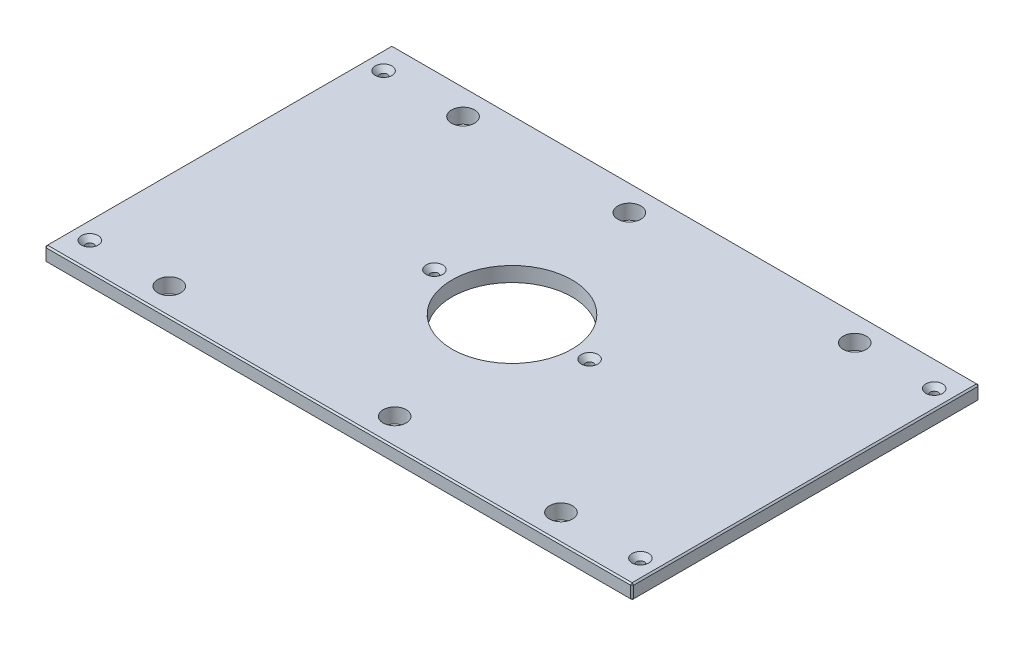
ISO-10303-21;
HEADER;
FILE_DESCRIPTION(('STEP AP214'),'2;1');
FILE_NAME('part.step','',(''),(''),'','','');
FILE_SCHEMA(('AUTOMOTIVE_DESIGN { 1 0 10303 214 1 1 1 1 }'));
ENDSEC;
DATA;
#1=APPLICATION_CONTEXT('core data for automotive mechanical design processes');
#2=APPLICATION_PROTOCOL_DEFINITION('international standard','automotive_design',2000,#1);
#3=PRODUCT_CONTEXT('',#1,'mechanical');
#4=PRODUCT('Part','Part','',(#3));
#5=PRODUCT_RELATED_PRODUCT_CATEGORY('part','',(#4));
#6=PRODUCT_DEFINITION_FORMATION('','',#4);
#7=PRODUCT_DEFINITION_CONTEXT('part definition',#1,'design');
#8=PRODUCT_DEFINITION('design','',#6,#7);
#9=PRODUCT_DEFINITION_SHAPE('','',#8);
#10=(LENGTH_UNIT() NAMED_UNIT(*) SI_UNIT(.MILLI.,.METRE.));
#11=(NAMED_UNIT(*) PLANE_ANGLE_UNIT() SI_UNIT($,.RADIAN.));
#12=(NAMED_UNIT(*) SI_UNIT($,.STERADIAN.) SOLID_ANGLE_UNIT());
#13=UNCERTAINTY_MEASURE_WITH_UNIT(LENGTH_MEASURE(1.E-05),#10,'distance_accuracy_value','');
#14=(GEOMETRIC_REPRESENTATION_CONTEXT(3) GLOBAL_UNCERTAINTY_ASSIGNED_CONTEXT((#13)) GLOBAL_UNIT_ASSIGNED_CONTEXT((#10,
#11,#12)) REPRESENTATION_CONTEXT('',''));
#15=CARTESIAN_POINT('',(0.,0.,0.));
#16=DIRECTION('',(0.,0.,1.));
#17=DIRECTION('',(1.,0.,0.));
#18=AXIS2_PLACEMENT_3D('',#15,#16,#17);
#19=CARTESIAN_POINT('',(-252.4125,12.7,-149.225));
#20=DIRECTION('',(1.,0.,0.));
#21=DIRECTION('',(0.,0.,-1.));
#22=AXIS2_PLACEMENT_3D('',#19,#20,#21);
#23=PLANE('',#22);
#24=DIRECTION('',(0.,0.,-1.));
#25=VECTOR('',#24,1.);
#26=CARTESIAN_POINT('',(-252.4125,11.4299999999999,-149.225));
#27=LINE('',#26,#25);
#28=CARTESIAN_POINT('',(-252.4125,11.4299999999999,147.955));
#29=VERTEX_POINT('',#28);
#30=CARTESIAN_POINT('',(-252.4125,11.4299999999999,-147.955));
#31=VERTEX_POINT('',#30);
#32=EDGE_CURVE('E135',#29,#31,#27,.T.);
#33=ORIENTED_EDGE('',*,*,#32,.T.);
#34=DIRECTION('',(0.,-1.,0.));
#35=VECTOR('',#34,1.);
#36=CARTESIAN_POINT('',(-252.4125,12.7,-147.955));
#37=LINE('',#36,#35);
#38=CARTESIAN_POINT('',(-252.4125,1.27000000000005,-147.955));
#39=VERTEX_POINT('',#38);
#40=EDGE_CURVE('E131',#31,#39,#37,.T.);
#41=ORIENTED_EDGE('',*,*,#40,.T.);
#42=DIRECTION('',(0.,0.,1.));
#43=VECTOR('',#42,1.);
#44=CARTESIAN_POINT('',(-252.4125,1.27000000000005,-149.225));
#45=LINE('',#44,#43);
#46=CARTESIAN_POINT('',(-252.4125,1.27000000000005,147.955));
#47=VERTEX_POINT('',#46);
#48=EDGE_CURVE('E126',#39,#47,#45,.T.);
#49=ORIENTED_EDGE('',*,*,#48,.T.);
#50=DIRECTION('',(0.,1.,0.));
#51=VECTOR('',#50,1.);
#52=CARTESIAN_POINT('',(-252.4125,12.7,147.955));
#53=LINE('',#52,#51);
#54=EDGE_CURVE('E128',#47,#29,#53,.T.);
#55=ORIENTED_EDGE('',*,*,#54,.T.);
#56=EDGE_LOOP('',(#33,#41,#49,#55));
#57=FACE_BOUND('',#56,.T.);
#58=ADVANCED_FACE('F35',(#57),#23,.F.);
#59=CARTESIAN_POINT('',(-252.4125,12.7,149.225));
#60=DIRECTION('',(0.,0.,-1.));
#61=DIRECTION('',(-1.,0.,0.));
#62=AXIS2_PLACEMENT_3D('',#59,#60,#61);
#63=PLANE('',#62);
#64=DIRECTION('',(1.,0.,0.));
#65=VECTOR('',#64,1.);
#66=CARTESIAN_POINT('',(-252.4125,1.26999999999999,149.225));
#67=LINE('',#66,#65);
#68=CARTESIAN_POINT('',(-251.1425,1.26999999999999,149.225));
#69=VERTEX_POINT('',#68);
#70=CARTESIAN_POINT('',(251.1425,1.26999999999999,149.225));
#71=VERTEX_POINT('',#70);
#72=EDGE_CURVE('E58',#69,#71,#67,.T.);
#73=ORIENTED_EDGE('',*,*,#72,.T.);
#74=DIRECTION('',(0.,1.,0.));
#75=VECTOR('',#74,1.);
#76=CARTESIAN_POINT('',(251.1425,12.7,149.225));
#77=LINE('',#76,#75);
#78=CARTESIAN_POINT('',(251.1425,11.43,149.225));
#79=VERTEX_POINT('',#78);
#80=EDGE_CURVE('E11',#71,#79,#77,.T.);
#81=ORIENTED_EDGE('',*,*,#80,.T.);
#82=DIRECTION('',(-1.,0.,0.));
#83=VECTOR('',#82,1.);
#84=CARTESIAN_POINT('',(-252.4125,11.43,149.225));
#85=LINE('',#84,#83);
#86=CARTESIAN_POINT('',(-251.1425,11.43,149.225));
#87=VERTEX_POINT('',#86);
#88=EDGE_CURVE('E44',#79,#87,#85,.T.);
#89=ORIENTED_EDGE('',*,*,#88,.T.);
#90=DIRECTION('',(0.,-1.,0.));
#91=VECTOR('',#90,1.);
#92=CARTESIAN_POINT('',(-251.1425,12.7,149.225));
#93=LINE('',#92,#91);
#94=EDGE_CURVE('E291',#87,#69,#93,.T.);
#95=ORIENTED_EDGE('',*,*,#94,.T.);
#96=EDGE_LOOP('',(#73,#81,#89,#95));
#97=FACE_BOUND('',#96,.T.);
#98=ADVANCED_FACE('F360',(#97),#63,.F.);
#99=CARTESIAN_POINT('',(252.4125,12.7,-149.225));
#100=DIRECTION('',(-1.,0.,0.));
#101=DIRECTION('',(0.,0.,1.));
#102=AXIS2_PLACEMENT_3D('',#99,#100,#101);
#103=PLANE('',#102);
#104=DIRECTION('',(0.,0.,-1.));
#105=VECTOR('',#104,1.);
#106=CARTESIAN_POINT('',(252.4125,1.26999999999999,-149.225));
#107=LINE('',#106,#105);
#108=CARTESIAN_POINT('',(252.4125,1.26999999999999,147.955));
#109=VERTEX_POINT('',#108);
#110=CARTESIAN_POINT('',(252.4125,1.26999999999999,-147.955));
#111=VERTEX_POINT('',#110);
#112=EDGE_CURVE('E286',#109,#111,#107,.T.);
#113=ORIENTED_EDGE('',*,*,#112,.T.);
#114=DIRECTION('',(0.,1.,0.));
#115=VECTOR('',#114,1.);
#116=CARTESIAN_POINT('',(252.4125,12.7,-147.955));
#117=LINE('',#116,#115);
#118=CARTESIAN_POINT('',(252.4125,11.4299999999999,-147.955));
#119=VERTEX_POINT('',#118);
#120=EDGE_CURVE('E288',#111,#119,#117,.T.);
#121=ORIENTED_EDGE('',*,*,#120,.T.);
#122=DIRECTION('',(0.,0.,1.));
#123=VECTOR('',#122,1.);
#124=CARTESIAN_POINT('',(252.4125,11.4299999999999,149.225));
#125=LINE('',#124,#123);
#126=CARTESIAN_POINT('',(252.4125,11.4299999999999,147.955));
#127=VERTEX_POINT('',#126);
#128=EDGE_CURVE('E284',#119,#127,#125,.T.);
#129=ORIENTED_EDGE('',*,*,#128,.T.);
#130=DIRECTION('',(0.,-1.,0.));
#131=VECTOR('',#130,1.);
#132=CARTESIAN_POINT('',(252.4125,12.7,147.955));
#133=LINE('',#132,#131);
#134=EDGE_CURVE('E282',#127,#109,#133,.T.);
#135=ORIENTED_EDGE('',*,*,#134,.T.);
#136=EDGE_LOOP('',(#113,#121,#129,#135));
#137=FACE_BOUND('',#136,.T.);
#138=ADVANCED_FACE('F347',(#137),#103,.F.);
#139=CARTESIAN_POINT('',(-252.4125,12.7,-149.225));
#140=DIRECTION('',(0.,0.,1.));
#141=DIRECTION('',(1.,0.,0.));
#142=AXIS2_PLACEMENT_3D('',#139,#140,#141);
#143=PLANE('',#142);
#144=DIRECTION('',(-1.,0.,0.));
#145=VECTOR('',#144,1.);
#146=CARTESIAN_POINT('',(-252.4125,1.26999999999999,-149.225));
#147=LINE('',#146,#145);
#148=CARTESIAN_POINT('',(251.1425,1.26999999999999,-149.225));
#149=VERTEX_POINT('',#148);
#150=CARTESIAN_POINT('',(-251.1425,1.26999999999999,-149.225));
#151=VERTEX_POINT('',#150);
#152=EDGE_CURVE('E258',#149,#151,#147,.T.);
#153=ORIENTED_EDGE('',*,*,#152,.T.);
#154=DIRECTION('',(0.,1.,0.));
#155=VECTOR('',#154,1.);
#156=CARTESIAN_POINT('',(-251.1425,12.7,-149.225));
#157=LINE('',#156,#155);
#158=CARTESIAN_POINT('',(-251.1425,11.4299999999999,-149.225));
#159=VERTEX_POINT('',#158);
#160=EDGE_CURVE('E262',#151,#159,#157,.T.);
#161=ORIENTED_EDGE('',*,*,#160,.T.);
#162=DIRECTION('',(1.,0.,0.));
#163=VECTOR('',#162,1.);
#164=CARTESIAN_POINT('',(252.4125,11.4299999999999,-149.225));
#165=LINE('',#164,#163);
#166=CARTESIAN_POINT('',(251.1425,11.4299999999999,-149.225));
#167=VERTEX_POINT('',#166);
#168=EDGE_CURVE('E260',#159,#167,#165,.T.);
#169=ORIENTED_EDGE('',*,*,#168,.T.);
#170=DIRECTION('',(0.,-1.,0.));
#171=VECTOR('',#170,1.);
#172=CARTESIAN_POINT('',(251.1425,12.7,-149.225));
#173=LINE('',#172,#171);
#174=EDGE_CURVE('E256',#167,#149,#173,.T.);
#175=ORIENTED_EDGE('',*,*,#174,.T.);
#176=EDGE_LOOP('',(#153,#161,#169,#175));
#177=FACE_BOUND('',#176,.T.);
#178=ADVANCED_FACE('F321',(#177),#143,.F.);
#179=CARTESIAN_POINT('',(0.,12.7,0.));
#180=DIRECTION('',(0.,1.,0.));
#181=DIRECTION('',(0.,0.,1.));
#182=AXIS2_PLACEMENT_3D('',#179,#180,#181);
#183=PLANE('',#182);
#184=CARTESIAN_POINT('',(236.5375,12.7,-126.20498));
#185=DIRECTION('',(0.,1.,0.));
#186=DIRECTION('',(0.,0.,1.));
#187=AXIS2_PLACEMENT_3D('',#184,#185,#186);
#188=CIRCLE('',#187,7.13739999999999);
#189=CARTESIAN_POINT('',(236.5375,12.7,-119.06758));
#190=VERTEX_POINT('',#189);
#191=EDGE_CURVE('E784',#190,#190,#188,.T.);
#192=ORIENTED_EDGE('',*,*,#191,.F.);
#193=EDGE_LOOP('',(#192));
#194=FACE_BOUND('',#193,.T.);
#195=CARTESIAN_POINT('',(236.5375,12.7,126.20498));
#196=DIRECTION('',(0.,1.,0.));
#197=DIRECTION('',(0.,0.,1.));
#198=AXIS2_PLACEMENT_3D('',#195,#196,#197);
#199=CIRCLE('',#198,7.13739999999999);
#200=CARTESIAN_POINT('',(236.5375,12.7,133.34238));
#201=VERTEX_POINT('',#200);
#202=EDGE_CURVE('E788',#201,#201,#199,.T.);
#203=ORIENTED_EDGE('',*,*,#202,.F.);
#204=EDGE_LOOP('',(#203));
#205=FACE_BOUND('',#204,.T.);
#206=CARTESIAN_POINT('',(-236.5375,12.7,126.20498));
#207=DIRECTION('',(0.,1.,0.));
#208=DIRECTION('',(0.,0.,1.));
#209=AXIS2_PLACEMENT_3D('',#206,#207,#208);
#210=CIRCLE('',#209,7.13739999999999);
#211=CARTESIAN_POINT('',(-236.5375,12.7,133.34238));
#212=VERTEX_POINT('',#211);
#213=EDGE_CURVE('E792',#212,#212,#210,.T.);
#214=ORIENTED_EDGE('',*,*,#213,.F.);
#215=EDGE_LOOP('',(#214));
#216=FACE_BOUND('',#215,.T.);
#217=CARTESIAN_POINT('',(-66.675,12.7,0.));
#218=DIRECTION('',(0.,1.,0.));
#219=DIRECTION('',(0.,0.,1.));
#220=AXIS2_PLACEMENT_3D('',#217,#218,#219);
#221=CIRCLE('',#220,7.1374);
#222=CARTESIAN_POINT('',(-66.675,12.7,7.1374));
#223=VERTEX_POINT('',#222);
#224=EDGE_CURVE('E796',#223,#223,#221,.T.);
#225=ORIENTED_EDGE('',*,*,#224,.F.);
#226=EDGE_LOOP('',(#225));
#227=FACE_BOUND('',#226,.T.);
#228=CARTESIAN_POINT('',(66.675,12.7,0.));
#229=DIRECTION('',(0.,1.,0.));
#230=DIRECTION('',(0.,0.,1.));
#231=AXIS2_PLACEMENT_3D('',#228,#229,#230);
#232=CIRCLE('',#231,7.1374);
#233=CARTESIAN_POINT('',(66.675,12.7,7.1374));
#234=VERTEX_POINT('',#233);
#235=EDGE_CURVE('E800',#234,#234,#232,.T.);
#236=ORIENTED_EDGE('',*,*,#235,.F.);
#237=EDGE_LOOP('',(#236));
#238=FACE_BOUND('',#237,.T.);
#239=CARTESIAN_POINT('',(-236.5375,12.7,-126.20498));
#240=DIRECTION('',(0.,1.,0.));
#241=DIRECTION('',(0.,0.,1.));
#242=AXIS2_PLACEMENT_3D('',#239,#240,#241);
#243=CIRCLE('',#242,7.13739999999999);
#244=CARTESIAN_POINT('',(-236.5375,12.7,-119.06758));
#245=VERTEX_POINT('',#244);
#246=EDGE_CURVE('E803',#245,#245,#243,.T.);
#247=ORIENTED_EDGE('',*,*,#246,.F.);
#248=EDGE_LOOP('',(#247));
#249=FACE_BOUND('',#248,.T.);
#250=DIRECTION('',(0.,0.,-1.));
#251=VECTOR('',#250,1.);
#252=CARTESIAN_POINT('',(251.1425,12.7,-149.225));
#253=LINE('',#252,#251);
#254=CARTESIAN_POINT('',(251.1425,12.7,147.955));
#255=VERTEX_POINT('',#254);
#256=CARTESIAN_POINT('',(251.1425,12.7,-147.955));
#257=VERTEX_POINT('',#256);
#258=EDGE_CURVE('E269',#255,#257,#253,.T.);
#259=ORIENTED_EDGE('',*,*,#258,.T.);
#260=DIRECTION('',(-1.,0.,0.));
#261=VECTOR('',#260,1.);
#262=CARTESIAN_POINT('',(-252.4125,12.7,-147.955));
#263=LINE('',#262,#261);
#264=CARTESIAN_POINT('',(-251.1425,12.7,-147.955));
#265=VERTEX_POINT('',#264);
#266=EDGE_CURVE('E271',#257,#265,#263,.T.);
#267=ORIENTED_EDGE('',*,*,#266,.T.);
#268=DIRECTION('',(0.,0.,1.));
#269=VECTOR('',#268,1.);
#270=CARTESIAN_POINT('',(-251.1425,12.7,149.225));
#271=LINE('',#270,#269);
#272=CARTESIAN_POINT('',(-251.1425,12.7,147.955));
#273=VERTEX_POINT('',#272);
#274=EDGE_CURVE('E267',#265,#273,#271,.T.);
#275=ORIENTED_EDGE('',*,*,#274,.T.);
#276=DIRECTION('',(1.,0.,0.));
#277=VECTOR('',#276,1.);
#278=CARTESIAN_POINT('',(252.4125,12.7,147.955));
#279=LINE('',#278,#277);
#280=EDGE_CURVE('E265',#273,#255,#279,.T.);
#281=ORIENTED_EDGE('',*,*,#280,.T.);
#282=EDGE_LOOP('',(#259,#267,#275,#281));
#283=FACE_BOUND('',#282,.T.);
#284=CARTESIAN_POINT('',(168.275,12.7,-126.20498));
#285=DIRECTION('',(0.,1.,0.));
#286=DIRECTION('',(0.,0.,1.));
#287=AXIS2_PLACEMENT_3D('',#284,#285,#286);
#288=CIRCLE('',#287,9.921875);
#289=CARTESIAN_POINT('',(168.275,12.7,-116.283105));
#290=VERTEX_POINT('',#289);
#291=EDGE_CURVE('E204',#290,#290,#288,.T.);
#292=ORIENTED_EDGE('',*,*,#291,.F.);
#293=EDGE_LOOP('',(#292));
#294=FACE_BOUND('',#293,.T.);
#295=CARTESIAN_POINT('',(-168.275,12.7,-126.20498));
#296=DIRECTION('',(0.,1.,0.));
#297=DIRECTION('',(0.,0.,1.));
#298=AXIS2_PLACEMENT_3D('',#295,#296,#297);
#299=CIRCLE('',#298,9.921875);
#300=CARTESIAN_POINT('',(-168.275,12.7,-116.283105));
#301=VERTEX_POINT('',#300);
#302=EDGE_CURVE('E214',#301,#301,#299,.T.);
#303=ORIENTED_EDGE('',*,*,#302,.F.);
#304=EDGE_LOOP('',(#303));
#305=FACE_BOUND('',#304,.T.);
#306=CARTESIAN_POINT('',(168.275,12.7,126.20498));
#307=DIRECTION('',(0.,1.,0.));
#308=DIRECTION('',(0.,0.,1.));
#309=AXIS2_PLACEMENT_3D('',#306,#307,#308);
#310=CIRCLE('',#309,9.921875);
#311=CARTESIAN_POINT('',(168.275,12.7,136.126855));
#312=VERTEX_POINT('',#311);
#313=EDGE_CURVE('E225',#312,#312,#310,.T.);
#314=ORIENTED_EDGE('',*,*,#313,.F.);
#315=EDGE_LOOP('',(#314));
#316=FACE_BOUND('',#315,.T.);
#317=CARTESIAN_POINT('',(-168.275,12.7,126.20498));
#318=DIRECTION('',(0.,1.,0.));
#319=DIRECTION('',(0.,0.,1.));
#320=AXIS2_PLACEMENT_3D('',#317,#318,#319);
#321=CIRCLE('',#320,9.921875);
#322=CARTESIAN_POINT('',(-168.275,12.7,136.126855));
#323=VERTEX_POINT('',#322);
#324=EDGE_CURVE('E231',#323,#323,#321,.T.);
#325=ORIENTED_EDGE('',*,*,#324,.F.);
#326=EDGE_LOOP('',(#325));
#327=FACE_BOUND('',#326,.T.);
#328=CARTESIAN_POINT('',(-25.4,12.7,-126.20498));
#329=DIRECTION('',(0.,1.,0.));
#330=DIRECTION('',(0.,0.,1.));
#331=AXIS2_PLACEMENT_3D('',#328,#329,#330);
#332=CIRCLE('',#331,9.921875);
#333=CARTESIAN_POINT('',(-25.4,12.7,-116.283105));
#334=VERTEX_POINT('',#333);
#335=EDGE_CURVE('E237',#334,#334,#332,.T.);
#336=ORIENTED_EDGE('',*,*,#335,.F.);
#337=EDGE_LOOP('',(#336));
#338=FACE_BOUND('',#337,.T.);
#339=CARTESIAN_POINT('',(25.4,12.7,126.20498));
#340=DIRECTION('',(0.,1.,0.));
#341=DIRECTION('',(0.,0.,1.));
#342=AXIS2_PLACEMENT_3D('',#339,#340,#341);
#343=CIRCLE('',#342,9.921875);
#344=CARTESIAN_POINT('',(25.4,12.7,136.126855));
#345=VERTEX_POINT('',#344);
#346=EDGE_CURVE('E243',#345,#345,#343,.T.);
#347=ORIENTED_EDGE('',*,*,#346,.F.);
#348=EDGE_LOOP('',(#347));
#349=FACE_BOUND('',#348,.T.);
#350=CARTESIAN_POINT('',(0.,12.7,0.));
#351=DIRECTION('',(0.,1.,0.));
#352=DIRECTION('',(0.,0.,1.));
#353=AXIS2_PLACEMENT_3D('',#350,#351,#352);
#354=CIRCLE('',#353,51.562);
#355=CARTESIAN_POINT('',(0.,12.7,51.562));
#356=VERTEX_POINT('',#355);
#357=EDGE_CURVE('E249',#356,#356,#354,.T.);
#358=ORIENTED_EDGE('',*,*,#357,.F.);
#359=EDGE_LOOP('',(#358));
#360=FACE_BOUND('',#359,.T.);
#361=ADVANCED_FACE('F369',(#194,#205,#216,#227,#238,#249,#283,#294,#305,#316,#327,#338,#349,
#360),#183,.T.);
#362=CARTESIAN_POINT('',(0.,0.,0.));
#363=DIRECTION('',(0.,1.,0.));
#364=DIRECTION('',(0.,0.,1.));
#365=AXIS2_PLACEMENT_3D('',#362,#363,#364);
#366=PLANE('',#365);
#367=CARTESIAN_POINT('',(236.5375,0.,-126.20498));
#368=DIRECTION('',(0.,1.,0.));
#369=DIRECTION('',(0.,0.,1.));
#370=AXIS2_PLACEMENT_3D('',#367,#368,#369);
#371=CIRCLE('',#370,3.3782);
#372=CARTESIAN_POINT('',(236.5375,0.,-122.82678));
#373=VERTEX_POINT('',#372);
#374=EDGE_CURVE('E837',#373,#373,#371,.T.);
#375=ORIENTED_EDGE('',*,*,#374,.T.);
#376=EDGE_LOOP('',(#375));
#377=FACE_BOUND('',#376,.T.);
#378=CARTESIAN_POINT('',(236.5375,0.,126.20498));
#379=DIRECTION('',(0.,1.,0.));
#380=DIRECTION('',(0.,0.,1.));
#381=AXIS2_PLACEMENT_3D('',#378,#379,#380);
#382=CIRCLE('',#381,3.3782);
#383=CARTESIAN_POINT('',(236.5375,0.,129.58318));
#384=VERTEX_POINT('',#383);
#385=EDGE_CURVE('E830',#384,#384,#382,.T.);
#386=ORIENTED_EDGE('',*,*,#385,.T.);
#387=EDGE_LOOP('',(#386));
#388=FACE_BOUND('',#387,.T.);
#389=CARTESIAN_POINT('',(-236.5375,0.,126.20498));
#390=DIRECTION('',(0.,1.,0.));
#391=DIRECTION('',(0.,0.,1.));
#392=AXIS2_PLACEMENT_3D('',#389,#390,#391);
#393=CIRCLE('',#392,3.3782);
#394=CARTESIAN_POINT('',(-236.5375,0.,129.58318));
#395=VERTEX_POINT('',#394);
#396=EDGE_CURVE('E823',#395,#395,#393,.T.);
#397=ORIENTED_EDGE('',*,*,#396,.T.);
#398=EDGE_LOOP('',(#397));
#399=FACE_BOUND('',#398,.T.);
#400=CARTESIAN_POINT('',(-66.675,0.,0.));
#401=DIRECTION('',(0.,1.,0.));
#402=DIRECTION('',(0.,0.,1.));
#403=AXIS2_PLACEMENT_3D('',#400,#401,#402);
#404=CIRCLE('',#403,3.3782);
#405=CARTESIAN_POINT('',(-66.675,0.,3.3782));
#406=VERTEX_POINT('',#405);
#407=EDGE_CURVE('E816',#406,#406,#404,.T.);
#408=ORIENTED_EDGE('',*,*,#407,.T.);
#409=EDGE_LOOP('',(#408));
#410=FACE_BOUND('',#409,.T.);
#411=CARTESIAN_POINT('',(66.675,0.,0.));
#412=DIRECTION('',(0.,1.,0.));
#413=DIRECTION('',(0.,0.,1.));
#414=AXIS2_PLACEMENT_3D('',#411,#412,#413);
#415=CIRCLE('',#414,3.3782);
#416=CARTESIAN_POINT('',(66.675,0.,3.3782));
#417=VERTEX_POINT('',#416);
#418=EDGE_CURVE('E806',#417,#417,#415,.T.);
#419=ORIENTED_EDGE('',*,*,#418,.T.);
#420=EDGE_LOOP('',(#419));
#421=FACE_BOUND('',#420,.T.);
#422=CARTESIAN_POINT('',(-236.5375,0.,-126.20498));
#423=DIRECTION('',(0.,1.,0.));
#424=DIRECTION('',(0.,0.,1.));
#425=AXIS2_PLACEMENT_3D('',#422,#423,#424);
#426=CIRCLE('',#425,3.3782);
#427=CARTESIAN_POINT('',(-236.5375,0.,-122.82678));
#428=VERTEX_POINT('',#427);
#429=EDGE_CURVE('E217',#428,#428,#426,.T.);
#430=ORIENTED_EDGE('',*,*,#429,.T.);
#431=EDGE_LOOP('',(#430));
#432=FACE_BOUND('',#431,.T.);
#433=DIRECTION('',(0.,0.,-1.));
#434=VECTOR('',#433,1.);
#435=CARTESIAN_POINT('',(-251.1425,0.,0.));
#436=LINE('',#435,#434);
#437=CARTESIAN_POINT('',(-251.1425,0.,147.955));
#438=VERTEX_POINT('',#437);
#439=CARTESIAN_POINT('',(-251.1425,0.,-147.955));
#440=VERTEX_POINT('',#439);
#441=EDGE_CURVE('E158',#438,#440,#436,.T.);
#442=ORIENTED_EDGE('',*,*,#441,.T.);
#443=DIRECTION('',(1.,0.,0.));
#444=VECTOR('',#443,1.);
#445=CARTESIAN_POINT('',(0.,0.,-147.955));
#446=LINE('',#445,#444);
#447=CARTESIAN_POINT('',(251.1425,0.,-147.955));
#448=VERTEX_POINT('',#447);
#449=EDGE_CURVE('E279',#440,#448,#446,.T.);
#450=ORIENTED_EDGE('',*,*,#449,.T.);
#451=DIRECTION('',(0.,0.,1.));
#452=VECTOR('',#451,1.);
#453=CARTESIAN_POINT('',(251.1425,0.,0.));
#454=LINE('',#453,#452);
#455=CARTESIAN_POINT('',(251.1425,0.,147.955));
#456=VERTEX_POINT('',#455);
#457=EDGE_CURVE('E277',#448,#456,#454,.T.);
#458=ORIENTED_EDGE('',*,*,#457,.T.);
#459=DIRECTION('',(-1.,0.,0.));
#460=VECTOR('',#459,1.);
#461=CARTESIAN_POINT('',(0.,0.,147.955));
#462=LINE('',#461,#460);
#463=EDGE_CURVE('E274',#456,#438,#462,.T.);
#464=ORIENTED_EDGE('',*,*,#463,.T.);
#465=EDGE_LOOP('',(#442,#450,#458,#464));
#466=FACE_BOUND('',#465,.T.);
#467=CARTESIAN_POINT('',(168.275,0.,-126.20498));
#468=DIRECTION('',(0.,1.,0.));
#469=DIRECTION('',(0.,0.,1.));
#470=AXIS2_PLACEMENT_3D('',#467,#468,#469);
#471=CIRCLE('',#470,9.921875);
#472=CARTESIAN_POINT('',(168.275,0.,-116.283105));
#473=VERTEX_POINT('',#472);
#474=EDGE_CURVE('E209',#473,#473,#471,.T.);
#475=ORIENTED_EDGE('',*,*,#474,.T.);
#476=EDGE_LOOP('',(#475));
#477=FACE_BOUND('',#476,.T.);
#478=CARTESIAN_POINT('',(-168.275,0.,-126.20498));
#479=DIRECTION('',(0.,1.,0.));
#480=DIRECTION('',(0.,0.,1.));
#481=AXIS2_PLACEMENT_3D('',#478,#479,#480);
#482=CIRCLE('',#481,9.921875);
#483=CARTESIAN_POINT('',(-168.275,0.,-116.283105));
#484=VERTEX_POINT('',#483);
#485=EDGE_CURVE('E222',#484,#484,#482,.T.);
#486=ORIENTED_EDGE('',*,*,#485,.T.);
#487=EDGE_LOOP('',(#486));
#488=FACE_BOUND('',#487,.T.);
#489=CARTESIAN_POINT('',(168.275,0.,126.20498));
#490=DIRECTION('',(0.,1.,0.));
#491=DIRECTION('',(0.,0.,1.));
#492=AXIS2_PLACEMENT_3D('',#489,#490,#491);
#493=CIRCLE('',#492,9.921875);
#494=CARTESIAN_POINT('',(168.275,0.,136.126855));
#495=VERTEX_POINT('',#494);
#496=EDGE_CURVE('E228',#495,#495,#493,.T.);
#497=ORIENTED_EDGE('',*,*,#496,.T.);
#498=EDGE_LOOP('',(#497));
#499=FACE_BOUND('',#498,.T.);
#500=CARTESIAN_POINT('',(-168.275,0.,126.20498));
#501=DIRECTION('',(0.,1.,0.));
#502=DIRECTION('',(0.,0.,1.));
#503=AXIS2_PLACEMENT_3D('',#500,#501,#502);
#504=CIRCLE('',#503,9.921875);
#505=CARTESIAN_POINT('',(-168.275,0.,136.126855));
#506=VERTEX_POINT('',#505);
#507=EDGE_CURVE('E234',#506,#506,#504,.T.);
#508=ORIENTED_EDGE('',*,*,#507,.T.);
#509=EDGE_LOOP('',(#508));
#510=FACE_BOUND('',#509,.T.);
#511=CARTESIAN_POINT('',(-25.4,0.,-126.20498));
#512=DIRECTION('',(0.,1.,0.));
#513=DIRECTION('',(0.,0.,1.));
#514=AXIS2_PLACEMENT_3D('',#511,#512,#513);
#515=CIRCLE('',#514,9.921875);
#516=CARTESIAN_POINT('',(-25.4,0.,-116.283105));
#517=VERTEX_POINT('',#516);
#518=EDGE_CURVE('E240',#517,#517,#515,.T.);
#519=ORIENTED_EDGE('',*,*,#518,.T.);
#520=EDGE_LOOP('',(#519));
#521=FACE_BOUND('',#520,.T.);
#522=CARTESIAN_POINT('',(25.4,0.,126.20498));
#523=DIRECTION('',(0.,1.,0.));
#524=DIRECTION('',(0.,0.,1.));
#525=AXIS2_PLACEMENT_3D('',#522,#523,#524);
#526=CIRCLE('',#525,9.921875);
#527=CARTESIAN_POINT('',(25.4,0.,136.126855));
#528=VERTEX_POINT('',#527);
#529=EDGE_CURVE('E246',#528,#528,#526,.T.);
#530=ORIENTED_EDGE('',*,*,#529,.T.);
#531=EDGE_LOOP('',(#530));
#532=FACE_BOUND('',#531,.T.);
#533=CARTESIAN_POINT('',(0.,0.,0.));
#534=DIRECTION('',(0.,1.,0.));
#535=DIRECTION('',(0.,0.,1.));
#536=AXIS2_PLACEMENT_3D('',#533,#534,#535);
#537=CIRCLE('',#536,51.562);
#538=CARTESIAN_POINT('',(0.,0.,51.562));
#539=VERTEX_POINT('',#538);
#540=EDGE_CURVE('E147',#539,#539,#537,.T.);
#541=ORIENTED_EDGE('',*,*,#540,.T.);
#542=EDGE_LOOP('',(#541));
#543=FACE_BOUND('',#542,.T.);
#544=ADVANCED_FACE('F334',(#377,#388,#399,#410,#421,#432,#466,#477,#488,#499,#510,#521,#532,
#543),#366,.F.);
#545=CARTESIAN_POINT('',(0.,0.,0.));
#546=DIRECTION('',(0.,1.,0.));
#547=DIRECTION('',(0.,0.,1.));
#548=AXIS2_PLACEMENT_3D('',#545,#546,#547);
#549=CYLINDRICAL_SURFACE('',#548,51.562);
#550=ORIENTED_EDGE('',*,*,#540,.F.);
#551=EDGE_LOOP('',(#550));
#552=FACE_BOUND('',#551,.T.);
#553=ORIENTED_EDGE('',*,*,#357,.T.);
#554=EDGE_LOOP('',(#553));
#555=FACE_BOUND('',#554,.T.);
#556=ADVANCED_FACE('F721',(#552,#555),#549,.F.);
#557=CARTESIAN_POINT('',(25.4,12.7,126.20498));
#558=DIRECTION('',(0.,1.,0.));
#559=DIRECTION('',(0.,0.,1.));
#560=AXIS2_PLACEMENT_3D('',#557,#558,#559);
#561=CYLINDRICAL_SURFACE('',#560,9.921875);
#562=ORIENTED_EDGE('',*,*,#529,.F.);
#563=EDGE_LOOP('',(#562));
#564=FACE_BOUND('',#563,.T.);
#565=ORIENTED_EDGE('',*,*,#346,.T.);
#566=EDGE_LOOP('',(#565));
#567=FACE_BOUND('',#566,.T.);
#568=ADVANCED_FACE('F712',(#564,#567),#561,.F.);
#569=CARTESIAN_POINT('',(-25.4,12.7,-126.20498));
#570=DIRECTION('',(0.,1.,0.));
#571=DIRECTION('',(0.,0.,1.));
#572=AXIS2_PLACEMENT_3D('',#569,#570,#571);
#573=CYLINDRICAL_SURFACE('',#572,9.921875);
#574=ORIENTED_EDGE('',*,*,#518,.F.);
#575=EDGE_LOOP('',(#574));
#576=FACE_BOUND('',#575,.T.);
#577=ORIENTED_EDGE('',*,*,#335,.T.);
#578=EDGE_LOOP('',(#577));
#579=FACE_BOUND('',#578,.T.);
#580=ADVANCED_FACE('F703',(#576,#579),#573,.F.);
#581=CARTESIAN_POINT('',(-168.275,12.7,126.20498));
#582=DIRECTION('',(0.,1.,0.));
#583=DIRECTION('',(0.,0.,1.));
#584=AXIS2_PLACEMENT_3D('',#581,#582,#583);
#585=CYLINDRICAL_SURFACE('',#584,9.921875);
#586=ORIENTED_EDGE('',*,*,#507,.F.);
#587=EDGE_LOOP('',(#586));
#588=FACE_BOUND('',#587,.T.);
#589=ORIENTED_EDGE('',*,*,#324,.T.);
#590=EDGE_LOOP('',(#589));
#591=FACE_BOUND('',#590,.T.);
#592=ADVANCED_FACE('F694',(#588,#591),#585,.F.);
#593=CARTESIAN_POINT('',(168.275,12.7,126.20498));
#594=DIRECTION('',(0.,1.,0.));
#595=DIRECTION('',(0.,0.,1.));
#596=AXIS2_PLACEMENT_3D('',#593,#594,#595);
#597=CYLINDRICAL_SURFACE('',#596,9.921875);
#598=ORIENTED_EDGE('',*,*,#496,.F.);
#599=EDGE_LOOP('',(#598));
#600=FACE_BOUND('',#599,.T.);
#601=ORIENTED_EDGE('',*,*,#313,.T.);
#602=EDGE_LOOP('',(#601));
#603=FACE_BOUND('',#602,.T.);
#604=ADVANCED_FACE('F685',(#600,#603),#597,.F.);
#605=CARTESIAN_POINT('',(-168.275,12.7,-126.20498));
#606=DIRECTION('',(0.,1.,0.));
#607=DIRECTION('',(0.,0.,1.));
#608=AXIS2_PLACEMENT_3D('',#605,#606,#607);
#609=CYLINDRICAL_SURFACE('',#608,9.921875);
#610=ORIENTED_EDGE('',*,*,#485,.F.);
#611=EDGE_LOOP('',(#610));
#612=FACE_BOUND('',#611,.T.);
#613=ORIENTED_EDGE('',*,*,#302,.T.);
#614=EDGE_LOOP('',(#613));
#615=FACE_BOUND('',#614,.T.);
#616=ADVANCED_FACE('F675',(#612,#615),#609,.F.);
#617=CARTESIAN_POINT('',(168.275,12.7,-126.20498));
#618=DIRECTION('',(0.,1.,0.));
#619=DIRECTION('',(0.,0.,1.));
#620=AXIS2_PLACEMENT_3D('',#617,#618,#619);
#621=CYLINDRICAL_SURFACE('',#620,9.921875);
#622=ORIENTED_EDGE('',*,*,#474,.F.);
#623=EDGE_LOOP('',(#622));
#624=FACE_BOUND('',#623,.T.);
#625=ORIENTED_EDGE('',*,*,#291,.T.);
#626=EDGE_LOOP('',(#625));
#627=FACE_BOUND('',#626,.T.);
#628=ADVANCED_FACE('F378',(#624,#627),#621,.F.);
#629=CARTESIAN_POINT('',(252.4125,12.7,147.955));
#630=DIRECTION('',(-0.707106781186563,0.,-0.707106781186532));
#631=DIRECTION('',(0.,-1.,0.));
#632=AXIS2_PLACEMENT_3D('',#629,#630,#631);
#633=PLANE('',#632);
#634=DIRECTION('',(-0.707106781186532,0.,0.707106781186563));
#635=VECTOR('',#634,1.);
#636=CARTESIAN_POINT('',(252.4125,11.4299999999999,147.955));
#637=LINE('',#636,#635);
#638=EDGE_CURVE('E39',#79,#127,#637,.F.);
#639=ORIENTED_EDGE('',*,*,#638,.F.);
#640=ORIENTED_EDGE('',*,*,#80,.F.);
#641=DIRECTION('',(0.707106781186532,0.,-0.707106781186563));
#642=VECTOR('',#641,1.);
#643=CARTESIAN_POINT('',(251.7775,1.26999999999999,148.59));
#644=LINE('',#643,#642);
#645=EDGE_CURVE('E197',#109,#71,#644,.F.);
#646=ORIENTED_EDGE('',*,*,#645,.F.);
#647=ORIENTED_EDGE('',*,*,#134,.F.);
#648=EDGE_LOOP('',(#639,#640,#646,#647));
#649=FACE_BOUND('',#648,.T.);
#650=ADVANCED_FACE('F37',(#649),#633,.F.);
#651=CARTESIAN_POINT('',(252.4125,11.4299999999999,147.955));
#652=DIRECTION('',(0.577350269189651,0.577350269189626,0.577350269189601));
#653=DIRECTION('',(-0.707106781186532,0.707106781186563,0.));
#654=AXIS2_PLACEMENT_3D('',#651,#652,#653);
#655=PLANE('',#654);
#656=DIRECTION('',(0.,-0.707106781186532,0.707106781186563));
#657=VECTOR('',#656,1.);
#658=CARTESIAN_POINT('',(251.1425,12.065,148.59));
#659=LINE('',#658,#657);
#660=EDGE_CURVE('E193',#79,#255,#659,.F.);
#661=ORIENTED_EDGE('',*,*,#660,.F.);
#662=ORIENTED_EDGE('',*,*,#638,.T.);
#663=DIRECTION('',(-0.707106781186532,0.707106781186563,0.));
#664=VECTOR('',#663,1.);
#665=CARTESIAN_POINT('',(252.4125,11.4299999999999,147.955));
#666=LINE('',#665,#664);
#667=EDGE_CURVE('E195',#255,#127,#666,.F.);
#668=ORIENTED_EDGE('',*,*,#667,.F.);
#669=EDGE_LOOP('',(#661,#662,#668));
#670=FACE_BOUND('',#669,.T.);
#671=ADVANCED_FACE('F371',(#670),#655,.T.);
#672=CARTESIAN_POINT('',(251.1425,0.,147.955));
#673=DIRECTION('',(0.577350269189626,-0.577350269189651,0.577350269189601));
#674=DIRECTION('',(0.707106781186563,0.707106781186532,0.));
#675=AXIS2_PLACEMENT_3D('',#672,#673,#674);
#676=PLANE('',#675);
#677=DIRECTION('',(-0.707106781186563,-0.707106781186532,0.));
#678=VECTOR('',#677,1.);
#679=CARTESIAN_POINT('',(251.1425,0.,147.955));
#680=LINE('',#679,#678);
#681=EDGE_CURVE('E187',#109,#456,#680,.T.);
#682=ORIENTED_EDGE('',*,*,#681,.F.);
#683=ORIENTED_EDGE('',*,*,#645,.T.);
#684=DIRECTION('',(0.,0.707106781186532,0.707106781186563));
#685=VECTOR('',#684,1.);
#686=CARTESIAN_POINT('',(251.1425,0.,147.955));
#687=LINE('',#686,#685);
#688=EDGE_CURVE('E190',#456,#71,#687,.T.);
#689=ORIENTED_EDGE('',*,*,#688,.F.);
#690=EDGE_LOOP('',(#682,#683,#689));
#691=FACE_BOUND('',#690,.T.);
#692=ADVANCED_FACE('F340',(#691),#676,.T.);
#693=CARTESIAN_POINT('',(251.1425,12.7,0.));
#694=DIRECTION('',(0.707106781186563,0.707106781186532,0.));
#695=DIRECTION('',(0.,0.,1.));
#696=AXIS2_PLACEMENT_3D('',#693,#694,#695);
#697=PLANE('',#696);
#698=ORIENTED_EDGE('',*,*,#667,.T.);
#699=ORIENTED_EDGE('',*,*,#128,.F.);
#700=DIRECTION('',(0.707106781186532,-0.707106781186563,0.));
#701=VECTOR('',#700,1.);
#702=CARTESIAN_POINT('',(251.7775,12.065,-147.955));
#703=LINE('',#702,#701);
#704=EDGE_CURVE('E182',#257,#119,#703,.T.);
#705=ORIENTED_EDGE('',*,*,#704,.F.);
#706=ORIENTED_EDGE('',*,*,#258,.F.);
#707=EDGE_LOOP('',(#698,#699,#705,#706));
#708=FACE_BOUND('',#707,.T.);
#709=ADVANCED_FACE('F357',(#708),#697,.T.);
#710=CARTESIAN_POINT('',(0.,12.7,147.955));
#711=DIRECTION('',(0.,0.707106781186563,0.707106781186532));
#712=DIRECTION('',(-1.,0.,0.));
#713=AXIS2_PLACEMENT_3D('',#710,#711,#712);
#714=PLANE('',#713);
#715=ORIENTED_EDGE('',*,*,#660,.T.);
#716=ORIENTED_EDGE('',*,*,#280,.F.);
#717=DIRECTION('',(0.,0.707106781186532,-0.707106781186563));
#718=VECTOR('',#717,1.);
#719=CARTESIAN_POINT('',(-251.1425,12.7,147.955));
#720=LINE('',#719,#718);
#721=EDGE_CURVE('E179',#87,#273,#720,.T.);
#722=ORIENTED_EDGE('',*,*,#721,.F.);
#723=ORIENTED_EDGE('',*,*,#88,.F.);
#724=EDGE_LOOP('',(#715,#716,#722,#723));
#725=FACE_BOUND('',#724,.T.);
#726=ADVANCED_FACE('F362',(#725),#714,.T.);
#727=CARTESIAN_POINT('',(-251.1425,12.7,149.225));
#728=DIRECTION('',(0.707106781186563,0.,-0.707106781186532));
#729=DIRECTION('',(0.,-1.,0.));
#730=AXIS2_PLACEMENT_3D('',#727,#728,#729);
#731=PLANE('',#730);
#732=DIRECTION('',(0.707106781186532,0.,0.707106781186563));
#733=VECTOR('',#732,1.);
#734=CARTESIAN_POINT('',(-252.4125,1.27000000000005,147.955));
#735=LINE('',#734,#733);
#736=EDGE_CURVE('E142',#69,#47,#735,.F.);
#737=ORIENTED_EDGE('',*,*,#736,.F.);
#738=ORIENTED_EDGE('',*,*,#94,.F.);
#739=DIRECTION('',(-0.707106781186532,0.,-0.707106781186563));
#740=VECTOR('',#739,1.);
#741=CARTESIAN_POINT('',(-251.7775,11.43,148.59));
#742=LINE('',#741,#740);
#743=EDGE_CURVE('E145',#29,#87,#742,.F.);
#744=ORIENTED_EDGE('',*,*,#743,.F.);
#745=ORIENTED_EDGE('',*,*,#54,.F.);
#746=EDGE_LOOP('',(#737,#738,#744,#745));
#747=FACE_BOUND('',#746,.T.);
#748=ADVANCED_FACE('F140',(#747),#731,.F.);
#749=CARTESIAN_POINT('',(-252.4125,1.26999999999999,149.225));
#750=DIRECTION('',(0.,0.707106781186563,-0.707106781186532));
#751=DIRECTION('',(1.,0.,0.));
#752=AXIS2_PLACEMENT_3D('',#749,#750,#751);
#753=PLANE('',#752);
#754=ORIENTED_EDGE('',*,*,#688,.T.);
#755=ORIENTED_EDGE('',*,*,#72,.F.);
#756=DIRECTION('',(0.,-0.707106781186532,-0.707106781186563));
#757=VECTOR('',#756,1.);
#758=CARTESIAN_POINT('',(-251.1425,0.634999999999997,148.59));
#759=LINE('',#758,#757);
#760=EDGE_CURVE('E155',#438,#69,#759,.F.);
#761=ORIENTED_EDGE('',*,*,#760,.F.);
#762=ORIENTED_EDGE('',*,*,#463,.F.);
#763=EDGE_LOOP('',(#754,#755,#761,#762));
#764=FACE_BOUND('',#763,.T.);
#765=ADVANCED_FACE('F339',(#764),#753,.F.);
#766=CARTESIAN_POINT('',(252.4125,1.26999999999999,-149.225));
#767=DIRECTION('',(-0.707106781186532,0.707106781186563,0.));
#768=DIRECTION('',(0.,0.,-1.));
#769=AXIS2_PLACEMENT_3D('',#766,#767,#768);
#770=PLANE('',#769);
#771=ORIENTED_EDGE('',*,*,#681,.T.);
#772=ORIENTED_EDGE('',*,*,#457,.F.);
#773=DIRECTION('',(0.707106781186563,0.707106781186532,0.));
#774=VECTOR('',#773,1.);
#775=CARTESIAN_POINT('',(251.1425,0.,-147.955));
#776=LINE('',#775,#774);
#777=EDGE_CURVE('E174',#111,#448,#776,.F.);
#778=ORIENTED_EDGE('',*,*,#777,.F.);
#779=ORIENTED_EDGE('',*,*,#112,.F.);
#780=EDGE_LOOP('',(#771,#772,#778,#779));
#781=FACE_BOUND('',#780,.T.);
#782=ADVANCED_FACE('F344',(#781),#770,.F.);
#783=CARTESIAN_POINT('',(251.1425,12.7,-149.225));
#784=DIRECTION('',(-0.707106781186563,0.,0.707106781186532));
#785=DIRECTION('',(0.,-1.,0.));
#786=AXIS2_PLACEMENT_3D('',#783,#784,#785);
#787=PLANE('',#786);
#788=DIRECTION('',(0.707106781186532,0.,0.707106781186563));
#789=VECTOR('',#788,1.);
#790=CARTESIAN_POINT('',(251.1425,11.4299999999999,-149.225));
#791=LINE('',#790,#789);
#792=EDGE_CURVE('E184',#119,#167,#791,.F.);
#793=ORIENTED_EDGE('',*,*,#792,.F.);
#794=ORIENTED_EDGE('',*,*,#120,.F.);
#795=DIRECTION('',(-0.707106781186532,0.,-0.707106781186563));
#796=VECTOR('',#795,1.);
#797=CARTESIAN_POINT('',(251.7775,1.26999999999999,-148.59));
#798=LINE('',#797,#796);
#799=EDGE_CURVE('E171',#149,#111,#798,.F.);
#800=ORIENTED_EDGE('',*,*,#799,.F.);
#801=ORIENTED_EDGE('',*,*,#174,.F.);
#802=EDGE_LOOP('',(#793,#794,#800,#801));
#803=FACE_BOUND('',#802,.T.);
#804=ADVANCED_FACE('F352',(#803),#787,.F.);
#805=CARTESIAN_POINT('',(251.1425,11.4299999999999,-149.225));
#806=DIRECTION('',(0.577350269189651,0.577350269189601,-0.577350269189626));
#807=DIRECTION('',(-0.707106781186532,0.,-0.707106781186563));
#808=AXIS2_PLACEMENT_3D('',#805,#806,#807);
#809=PLANE('',#808);
#810=ORIENTED_EDGE('',*,*,#704,.T.);
#811=ORIENTED_EDGE('',*,*,#792,.T.);
#812=DIRECTION('',(0.,0.707106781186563,0.707106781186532));
#813=VECTOR('',#812,1.);
#814=CARTESIAN_POINT('',(251.1425,11.4299999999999,-149.225));
#815=LINE('',#814,#813);
#816=EDGE_CURVE('E163',#257,#167,#815,.F.);
#817=ORIENTED_EDGE('',*,*,#816,.F.);
#818=EDGE_LOOP('',(#810,#811,#817));
#819=FACE_BOUND('',#818,.T.);
#820=ADVANCED_FACE('F410',(#819),#809,.T.);
#821=CARTESIAN_POINT('',(-251.1425,12.7,147.955));
#822=DIRECTION('',(-0.577350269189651,0.577350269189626,0.577350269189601));
#823=DIRECTION('',(-0.707106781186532,-0.707106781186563,0.));
#824=AXIS2_PLACEMENT_3D('',#821,#822,#823);
#825=PLANE('',#824);
#826=ORIENTED_EDGE('',*,*,#743,.T.);
#827=ORIENTED_EDGE('',*,*,#721,.T.);
#828=DIRECTION('',(-0.707106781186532,-0.707106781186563,0.));
#829=VECTOR('',#828,1.);
#830=CARTESIAN_POINT('',(-251.1425,12.7,147.955));
#831=LINE('',#830,#829);
#832=EDGE_CURVE('E159',#29,#273,#831,.F.);
#833=ORIENTED_EDGE('',*,*,#832,.F.);
#834=EDGE_LOOP('',(#826,#827,#833));
#835=FACE_BOUND('',#834,.T.);
#836=ADVANCED_FACE('F364',(#835),#825,.T.);
#837=CARTESIAN_POINT('',(-252.4125,1.27000000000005,147.955));
#838=DIRECTION('',(-0.577350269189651,-0.577350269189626,0.577350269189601));
#839=DIRECTION('',(0.707106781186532,-0.707106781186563,0.));
#840=AXIS2_PLACEMENT_3D('',#837,#838,#839);
#841=PLANE('',#840);
#842=ORIENTED_EDGE('',*,*,#760,.T.);
#843=ORIENTED_EDGE('',*,*,#736,.T.);
#844=DIRECTION('',(-0.707106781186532,0.707106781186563,0.));
#845=VECTOR('',#844,1.);
#846=CARTESIAN_POINT('',(-252.4125,1.27000000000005,147.955));
#847=LINE('',#846,#845);
#848=EDGE_CURVE('E152',#438,#47,#847,.T.);
#849=ORIENTED_EDGE('',*,*,#848,.F.);
#850=EDGE_LOOP('',(#842,#843,#849));
#851=FACE_BOUND('',#850,.T.);
#852=ADVANCED_FACE('F151',(#851),#841,.T.);
#853=CARTESIAN_POINT('',(251.1425,0.,-147.955));
#854=DIRECTION('',(0.577350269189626,-0.577350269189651,-0.577350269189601));
#855=DIRECTION('',(0.707106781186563,0.707106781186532,0.));
#856=AXIS2_PLACEMENT_3D('',#853,#854,#855);
#857=PLANE('',#856);
#858=ORIENTED_EDGE('',*,*,#799,.T.);
#859=ORIENTED_EDGE('',*,*,#777,.T.);
#860=DIRECTION('',(0.,-0.707106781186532,0.707106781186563));
#861=VECTOR('',#860,1.);
#862=CARTESIAN_POINT('',(251.1425,0.,-147.955));
#863=LINE('',#862,#861);
#864=EDGE_CURVE('E160',#149,#448,#863,.T.);
#865=ORIENTED_EDGE('',*,*,#864,.F.);
#866=EDGE_LOOP('',(#858,#859,#865));
#867=FACE_BOUND('',#866,.T.);
#868=ADVANCED_FACE('F402',(#867),#857,.T.);
#869=CARTESIAN_POINT('',(0.,12.7,-147.955));
#870=DIRECTION('',(0.,0.707106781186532,-0.707106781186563));
#871=DIRECTION('',(1.,0.,0.));
#872=AXIS2_PLACEMENT_3D('',#869,#870,#871);
#873=PLANE('',#872);
#874=ORIENTED_EDGE('',*,*,#816,.T.);
#875=ORIENTED_EDGE('',*,*,#168,.F.);
#876=DIRECTION('',(0.,-0.707106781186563,-0.707106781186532));
#877=VECTOR('',#876,1.);
#878=CARTESIAN_POINT('',(-251.1425,11.4299999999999,-149.225));
#879=LINE('',#878,#877);
#880=EDGE_CURVE('E165',#265,#159,#879,.T.);
#881=ORIENTED_EDGE('',*,*,#880,.F.);
#882=ORIENTED_EDGE('',*,*,#266,.F.);
#883=EDGE_LOOP('',(#874,#875,#881,#882));
#884=FACE_BOUND('',#883,.T.);
#885=ADVANCED_FACE('F316',(#884),#873,.T.);
#886=CARTESIAN_POINT('',(-251.1425,12.7,0.));
#887=DIRECTION('',(-0.707106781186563,0.707106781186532,0.));
#888=DIRECTION('',(0.,0.,-1.));
#889=AXIS2_PLACEMENT_3D('',#886,#887,#888);
#890=PLANE('',#889);
#891=ORIENTED_EDGE('',*,*,#832,.T.);
#892=ORIENTED_EDGE('',*,*,#274,.F.);
#893=DIRECTION('',(0.707106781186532,0.707106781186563,0.));
#894=VECTOR('',#893,1.);
#895=CARTESIAN_POINT('',(-251.7775,12.065,-147.955));
#896=LINE('',#895,#894);
#897=EDGE_CURVE('E305',#31,#265,#896,.T.);
#898=ORIENTED_EDGE('',*,*,#897,.F.);
#899=ORIENTED_EDGE('',*,*,#32,.F.);
#900=EDGE_LOOP('',(#891,#892,#898,#899));
#901=FACE_BOUND('',#900,.T.);
#902=ADVANCED_FACE('F367',(#901),#890,.T.);
#903=CARTESIAN_POINT('',(-252.4125,1.27000000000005,-149.225));
#904=DIRECTION('',(0.707106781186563,0.707106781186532,0.));
#905=DIRECTION('',(0.,0.,1.));
#906=AXIS2_PLACEMENT_3D('',#903,#904,#905);
#907=PLANE('',#906);
#908=ORIENTED_EDGE('',*,*,#848,.T.);
#909=ORIENTED_EDGE('',*,*,#48,.F.);
#910=DIRECTION('',(0.707106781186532,-0.707106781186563,0.));
#911=VECTOR('',#910,1.);
#912=CARTESIAN_POINT('',(-252.4125,1.27000000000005,-147.955));
#913=LINE('',#912,#911);
#914=EDGE_CURVE('E302',#440,#39,#913,.F.);
#915=ORIENTED_EDGE('',*,*,#914,.F.);
#916=ORIENTED_EDGE('',*,*,#441,.F.);
#917=EDGE_LOOP('',(#908,#909,#915,#916));
#918=FACE_BOUND('',#917,.T.);
#919=ADVANCED_FACE('F157',(#918),#907,.F.);
#920=CARTESIAN_POINT('',(-252.4125,1.26999999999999,-149.225));
#921=DIRECTION('',(0.,0.707106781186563,0.707106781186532));
#922=DIRECTION('',(-1.,0.,0.));
#923=AXIS2_PLACEMENT_3D('',#920,#921,#922);
#924=PLANE('',#923);
#925=ORIENTED_EDGE('',*,*,#864,.T.);
#926=ORIENTED_EDGE('',*,*,#449,.F.);
#927=DIRECTION('',(0.,0.707106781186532,-0.707106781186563));
#928=VECTOR('',#927,1.);
#929=CARTESIAN_POINT('',(-251.1425,0.634999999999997,-148.59));
#930=LINE('',#929,#928);
#931=EDGE_CURVE('E299',#151,#440,#930,.F.);
#932=ORIENTED_EDGE('',*,*,#931,.F.);
#933=ORIENTED_EDGE('',*,*,#152,.F.);
#934=EDGE_LOOP('',(#925,#926,#932,#933));
#935=FACE_BOUND('',#934,.T.);
#936=ADVANCED_FACE('F331',(#935),#924,.F.);
#937=CARTESIAN_POINT('',(-251.1425,11.4299999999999,-149.225));
#938=DIRECTION('',(-0.577350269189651,0.577350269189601,-0.577350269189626));
#939=DIRECTION('',(-0.707106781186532,0.,0.707106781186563));
#940=AXIS2_PLACEMENT_3D('',#937,#938,#939);
#941=PLANE('',#940);
#942=ORIENTED_EDGE('',*,*,#897,.T.);
#943=ORIENTED_EDGE('',*,*,#880,.T.);
#944=DIRECTION('',(0.707106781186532,0.,-0.707106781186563));
#945=VECTOR('',#944,1.);
#946=CARTESIAN_POINT('',(-251.1425,11.4299999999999,-149.225));
#947=LINE('',#946,#945);
#948=EDGE_CURVE('E297',#31,#159,#947,.T.);
#949=ORIENTED_EDGE('',*,*,#948,.F.);
#950=EDGE_LOOP('',(#942,#943,#949));
#951=FACE_BOUND('',#950,.T.);
#952=ADVANCED_FACE('F311',(#951),#941,.T.);
#953=CARTESIAN_POINT('',(-252.4125,1.27000000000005,-147.955));
#954=DIRECTION('',(-0.577350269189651,-0.577350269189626,-0.577350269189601));
#955=DIRECTION('',(0.707106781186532,-0.707106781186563,0.));
#956=AXIS2_PLACEMENT_3D('',#953,#954,#955);
#957=PLANE('',#956);
#958=ORIENTED_EDGE('',*,*,#931,.T.);
#959=ORIENTED_EDGE('',*,*,#914,.T.);
#960=DIRECTION('',(-0.707106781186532,0.,0.707106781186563));
#961=VECTOR('',#960,1.);
#962=CARTESIAN_POINT('',(-252.4125,1.27000000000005,-147.955));
#963=LINE('',#962,#961);
#964=EDGE_CURVE('E295',#151,#39,#963,.T.);
#965=ORIENTED_EDGE('',*,*,#964,.F.);
#966=EDGE_LOOP('',(#958,#959,#965));
#967=FACE_BOUND('',#966,.T.);
#968=ADVANCED_FACE('F328',(#967),#957,.T.);
#969=CARTESIAN_POINT('',(-252.4125,12.7,-147.955));
#970=DIRECTION('',(0.707106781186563,0.,0.707106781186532));
#971=DIRECTION('',(0.,-1.,0.));
#972=AXIS2_PLACEMENT_3D('',#969,#970,#971);
#973=PLANE('',#972);
#974=ORIENTED_EDGE('',*,*,#948,.T.);
#975=ORIENTED_EDGE('',*,*,#160,.F.);
#976=ORIENTED_EDGE('',*,*,#964,.T.);
#977=ORIENTED_EDGE('',*,*,#40,.F.);
#978=EDGE_LOOP('',(#974,#975,#976,#977));
#979=FACE_BOUND('',#978,.T.);
#980=ADVANCED_FACE('F326',(#979),#973,.F.);
#981=CARTESIAN_POINT('',(-236.5375,12.7,-126.20498));
#982=DIRECTION('',(0.,1.,0.));
#983=DIRECTION('',(0.,0.,1.));
#984=AXIS2_PLACEMENT_3D('',#981,#982,#983);
#985=CYLINDRICAL_SURFACE('',#984,3.3782);
#986=ORIENTED_EDGE('',*,*,#429,.F.);
#987=EDGE_LOOP('',(#986));
#988=FACE_BOUND('',#987,.T.);
#989=CARTESIAN_POINT('',(-236.5375,8.37553508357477,-126.20498));
#990=DIRECTION('',(0.,1.,0.));
#991=DIRECTION('',(0.,0.,1.));
#992=AXIS2_PLACEMENT_3D('',#989,#990,#991);
#993=CIRCLE('',#992,3.3782);
#994=CARTESIAN_POINT('',(-236.5375,8.37553508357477,-122.82678));
#995=VERTEX_POINT('',#994);
#996=EDGE_CURVE('E805',#995,#995,#993,.T.);
#997=ORIENTED_EDGE('',*,*,#996,.T.);
#998=EDGE_LOOP('',(#997));
#999=FACE_BOUND('',#998,.T.);
#1000=ADVANCED_FACE('F389',(#988,#999),#985,.F.);
#1001=CARTESIAN_POINT('',(-236.5375,12.7,-126.20498));
#1002=DIRECTION('',(0.,1.,0.));
#1003=DIRECTION('',(0.,0.,1.));
#1004=AXIS2_PLACEMENT_3D('',#1001,#1002,#1003);
#1005=CONICAL_SURFACE('',#1004,7.13739999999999,0.715584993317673);
#1006=ORIENTED_EDGE('',*,*,#996,.F.);
#1007=EDGE_LOOP('',(#1006));
#1008=FACE_BOUND('',#1007,.T.);
#1009=ORIENTED_EDGE('',*,*,#246,.T.);
#1010=EDGE_LOOP('',(#1009));
#1011=FACE_BOUND('',#1010,.T.);
#1012=ADVANCED_FACE('F499',(#1008,#1011),#1005,.F.);
#1013=CARTESIAN_POINT('',(66.675,12.7,0.));
#1014=DIRECTION('',(0.,1.,0.));
#1015=DIRECTION('',(0.,0.,1.));
#1016=AXIS2_PLACEMENT_3D('',#1013,#1014,#1015);
#1017=CYLINDRICAL_SURFACE('',#1016,3.3782);
#1018=ORIENTED_EDGE('',*,*,#418,.F.);
#1019=EDGE_LOOP('',(#1018));
#1020=FACE_BOUND('',#1019,.T.);
#1021=CARTESIAN_POINT('',(66.675,8.37553508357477,0.));
#1022=DIRECTION('',(0.,1.,0.));
#1023=DIRECTION('',(0.,0.,1.));
#1024=AXIS2_PLACEMENT_3D('',#1021,#1022,#1023);
#1025=CIRCLE('',#1024,3.3782);
#1026=CARTESIAN_POINT('',(66.675,8.37553508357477,3.3782));
#1027=VERTEX_POINT('',#1026);
#1028=EDGE_CURVE('E810',#1027,#1027,#1025,.T.);
#1029=ORIENTED_EDGE('',*,*,#1028,.T.);
#1030=EDGE_LOOP('',(#1029));
#1031=FACE_BOUND('',#1030,.T.);
#1032=ADVANCED_FACE('F508',(#1020,#1031),#1017,.F.);
#1033=CARTESIAN_POINT('',(66.675,12.7,0.));
#1034=DIRECTION('',(0.,1.,0.));
#1035=DIRECTION('',(0.,0.,1.));
#1036=AXIS2_PLACEMENT_3D('',#1033,#1034,#1035);
#1037=CONICAL_SURFACE('',#1036,7.1374,0.715584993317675);
#1038=ORIENTED_EDGE('',*,*,#1028,.F.);
#1039=EDGE_LOOP('',(#1038));
#1040=FACE_BOUND('',#1039,.T.);
#1041=ORIENTED_EDGE('',*,*,#235,.T.);
#1042=EDGE_LOOP('',(#1041));
#1043=FACE_BOUND('',#1042,.T.);
#1044=ADVANCED_FACE('F516',(#1040,#1043),#1037,.F.);
#1045=CARTESIAN_POINT('',(-66.675,12.7,0.));
#1046=DIRECTION('',(0.,1.,0.));
#1047=DIRECTION('',(0.,0.,1.));
#1048=AXIS2_PLACEMENT_3D('',#1045,#1046,#1047);
#1049=CYLINDRICAL_SURFACE('',#1048,3.3782);
#1050=ORIENTED_EDGE('',*,*,#407,.F.);
#1051=EDGE_LOOP('',(#1050));
#1052=FACE_BOUND('',#1051,.T.);
#1053=CARTESIAN_POINT('',(-66.675,8.37553508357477,0.));
#1054=DIRECTION('',(0.,1.,0.));
#1055=DIRECTION('',(0.,0.,1.));
#1056=AXIS2_PLACEMENT_3D('',#1053,#1054,#1055);
#1057=CIRCLE('',#1056,3.3782);
#1058=CARTESIAN_POINT('',(-66.675,8.37553508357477,3.3782));
#1059=VERTEX_POINT('',#1058);
#1060=EDGE_CURVE('E819',#1059,#1059,#1057,.T.);
#1061=ORIENTED_EDGE('',*,*,#1060,.T.);
#1062=EDGE_LOOP('',(#1061));
#1063=FACE_BOUND('',#1062,.T.);
#1064=ADVANCED_FACE('F524',(#1052,#1063),#1049,.F.);
#1065=CARTESIAN_POINT('',(-66.675,12.7,0.));
#1066=DIRECTION('',(0.,1.,0.));
#1067=DIRECTION('',(0.,0.,1.));
#1068=AXIS2_PLACEMENT_3D('',#1065,#1066,#1067);
#1069=CONICAL_SURFACE('',#1068,7.1374,0.715584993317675);
#1070=ORIENTED_EDGE('',*,*,#1060,.F.);
#1071=EDGE_LOOP('',(#1070));
#1072=FACE_BOUND('',#1071,.T.);
#1073=ORIENTED_EDGE('',*,*,#224,.T.);
#1074=EDGE_LOOP('',(#1073));
#1075=FACE_BOUND('',#1074,.T.);
#1076=ADVANCED_FACE('F532',(#1072,#1075),#1069,.F.);
#1077=CARTESIAN_POINT('',(-236.5375,12.7,126.20498));
#1078=DIRECTION('',(0.,1.,0.));
#1079=DIRECTION('',(0.,0.,1.));
#1080=AXIS2_PLACEMENT_3D('',#1077,#1078,#1079);
#1081=CYLINDRICAL_SURFACE('',#1080,3.3782);
#1082=ORIENTED_EDGE('',*,*,#396,.F.);
#1083=EDGE_LOOP('',(#1082));
#1084=FACE_BOUND('',#1083,.T.);
#1085=CARTESIAN_POINT('',(-236.5375,8.37553508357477,126.20498));
#1086=DIRECTION('',(0.,1.,0.));
#1087=DIRECTION('',(0.,0.,1.));
#1088=AXIS2_PLACEMENT_3D('',#1085,#1086,#1087);
#1089=CIRCLE('',#1088,3.3782);
#1090=CARTESIAN_POINT('',(-236.5375,8.37553508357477,129.58318));
#1091=VERTEX_POINT('',#1090);
#1092=EDGE_CURVE('E826',#1091,#1091,#1089,.T.);
#1093=ORIENTED_EDGE('',*,*,#1092,.T.);
#1094=EDGE_LOOP('',(#1093));
#1095=FACE_BOUND('',#1094,.T.);
#1096=ADVANCED_FACE('F540',(#1084,#1095),#1081,.F.);
#1097=CARTESIAN_POINT('',(-236.5375,12.7,126.20498));
#1098=DIRECTION('',(0.,1.,0.));
#1099=DIRECTION('',(0.,0.,1.));
#1100=AXIS2_PLACEMENT_3D('',#1097,#1098,#1099);
#1101=CONICAL_SURFACE('',#1100,7.13739999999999,0.715584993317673);
#1102=ORIENTED_EDGE('',*,*,#1092,.F.);
#1103=EDGE_LOOP('',(#1102));
#1104=FACE_BOUND('',#1103,.T.);
#1105=ORIENTED_EDGE('',*,*,#213,.T.);
#1106=EDGE_LOOP('',(#1105));
#1107=FACE_BOUND('',#1106,.T.);
#1108=ADVANCED_FACE('F548',(#1104,#1107),#1101,.F.);
#1109=CARTESIAN_POINT('',(236.5375,12.7,126.20498));
#1110=DIRECTION('',(0.,1.,0.));
#1111=DIRECTION('',(0.,0.,1.));
#1112=AXIS2_PLACEMENT_3D('',#1109,#1110,#1111);
#1113=CYLINDRICAL_SURFACE('',#1112,3.3782);
#1114=ORIENTED_EDGE('',*,*,#385,.F.);
#1115=EDGE_LOOP('',(#1114));
#1116=FACE_BOUND('',#1115,.T.);
#1117=CARTESIAN_POINT('',(236.5375,8.37553508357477,126.20498));
#1118=DIRECTION('',(0.,1.,0.));
#1119=DIRECTION('',(0.,0.,1.));
#1120=AXIS2_PLACEMENT_3D('',#1117,#1118,#1119);
#1121=CIRCLE('',#1120,3.3782);
#1122=CARTESIAN_POINT('',(236.5375,8.37553508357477,129.58318));
#1123=VERTEX_POINT('',#1122);
#1124=EDGE_CURVE('E833',#1123,#1123,#1121,.T.);
#1125=ORIENTED_EDGE('',*,*,#1124,.T.);
#1126=EDGE_LOOP('',(#1125));
#1127=FACE_BOUND('',#1126,.T.);
#1128=ADVANCED_FACE('F556',(#1116,#1127),#1113,.F.);
#1129=CARTESIAN_POINT('',(236.5375,12.7,126.20498));
#1130=DIRECTION('',(0.,1.,0.));
#1131=DIRECTION('',(0.,0.,1.));
#1132=AXIS2_PLACEMENT_3D('',#1129,#1130,#1131);
#1133=CONICAL_SURFACE('',#1132,7.13739999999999,0.715584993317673);
#1134=ORIENTED_EDGE('',*,*,#1124,.F.);
#1135=EDGE_LOOP('',(#1134));
#1136=FACE_BOUND('',#1135,.T.);
#1137=ORIENTED_EDGE('',*,*,#202,.T.);
#1138=EDGE_LOOP('',(#1137));
#1139=FACE_BOUND('',#1138,.T.);
#1140=ADVANCED_FACE('F564',(#1136,#1139),#1133,.F.);
#1141=CARTESIAN_POINT('',(236.5375,12.7,-126.20498));
#1142=DIRECTION('',(0.,1.,0.));
#1143=DIRECTION('',(0.,0.,1.));
#1144=AXIS2_PLACEMENT_3D('',#1141,#1142,#1143);
#1145=CYLINDRICAL_SURFACE('',#1144,3.3782);
#1146=ORIENTED_EDGE('',*,*,#374,.F.);
#1147=EDGE_LOOP('',(#1146));
#1148=FACE_BOUND('',#1147,.T.);
#1149=CARTESIAN_POINT('',(236.5375,8.37553508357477,-126.20498));
#1150=DIRECTION('',(0.,1.,0.));
#1151=DIRECTION('',(0.,0.,1.));
#1152=AXIS2_PLACEMENT_3D('',#1149,#1150,#1151);
#1153=CIRCLE('',#1152,3.3782);
#1154=CARTESIAN_POINT('',(236.5375,8.37553508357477,-122.82678));
#1155=VERTEX_POINT('',#1154);
#1156=EDGE_CURVE('E840',#1155,#1155,#1153,.T.);
#1157=ORIENTED_EDGE('',*,*,#1156,.T.);
#1158=EDGE_LOOP('',(#1157));
#1159=FACE_BOUND('',#1158,.T.);
#1160=ADVANCED_FACE('F572',(#1148,#1159),#1145,.F.);
#1161=CARTESIAN_POINT('',(236.5375,12.7,-126.20498));
#1162=DIRECTION('',(0.,1.,0.));
#1163=DIRECTION('',(0.,0.,1.));
#1164=AXIS2_PLACEMENT_3D('',#1161,#1162,#1163);
#1165=CONICAL_SURFACE('',#1164,7.13739999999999,0.715584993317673);
#1166=ORIENTED_EDGE('',*,*,#1156,.F.);
#1167=EDGE_LOOP('',(#1166));
#1168=FACE_BOUND('',#1167,.T.);
#1169=ORIENTED_EDGE('',*,*,#191,.T.);
#1170=EDGE_LOOP('',(#1169));
#1171=FACE_BOUND('',#1170,.T.);
#1172=ADVANCED_FACE('F580',(#1168,#1171),#1165,.F.);
#1173=CLOSED_SHELL('',(#58,#98,#138,#178,#361,#544,#556,#568,#580,#592,#604,#616,#628,#650,#671,
#692,#709,#726,#748,#765,#782,#804,#820,#836,#852,#868,#885,#902,#919,#936,#952,#968,#980,#1000,
#1012,#1032,#1044,#1064,#1076,#1096,#1108,#1128,#1140,#1160,#1172));
#1174=MANIFOLD_SOLID_BREP('B2',#1173);
#1175=ADVANCED_BREP_SHAPE_REPRESENTATION('',(#18,#1174),#14);
#1176=SHAPE_DEFINITION_REPRESENTATION(#9,#1175);
ENDSEC;
END-ISO-10303-21;
